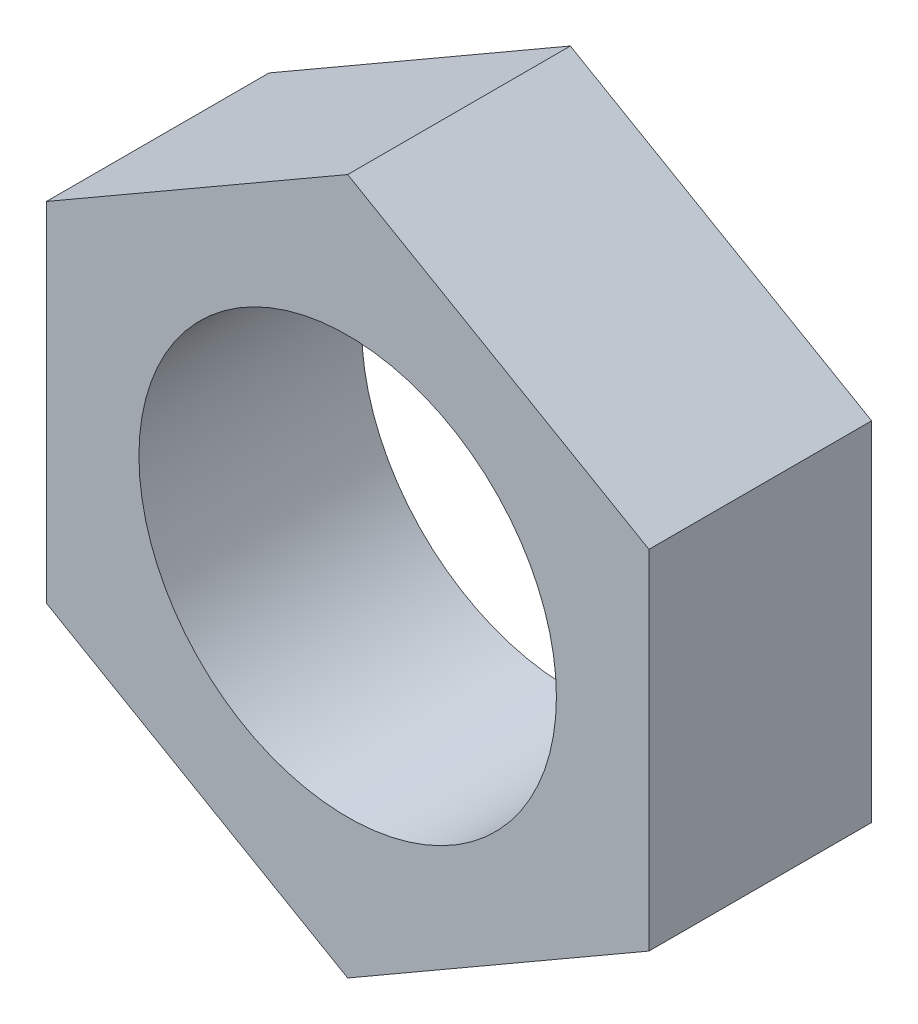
ISO-10303-21;
HEADER;
FILE_DESCRIPTION(('STEP AP214'),'2;1');
FILE_NAME('part.step','',(''),(''),'','','');
FILE_SCHEMA(('AUTOMOTIVE_DESIGN { 1 0 10303 214 1 1 1 1 }'));
ENDSEC;
DATA;
#1=APPLICATION_CONTEXT('core data for automotive mechanical design processes');
#2=APPLICATION_PROTOCOL_DEFINITION('international standard','automotive_design',2000,#1);
#3=PRODUCT_CONTEXT('',#1,'mechanical');
#4=PRODUCT('Part','Part','',(#3));
#5=PRODUCT_RELATED_PRODUCT_CATEGORY('part','',(#4));
#6=PRODUCT_DEFINITION_FORMATION('','',#4);
#7=PRODUCT_DEFINITION_CONTEXT('part definition',#1,'design');
#8=PRODUCT_DEFINITION('design','',#6,#7);
#9=PRODUCT_DEFINITION_SHAPE('','',#8);
#10=(LENGTH_UNIT() NAMED_UNIT(*) SI_UNIT(.MILLI.,.METRE.));
#11=(NAMED_UNIT(*) PLANE_ANGLE_UNIT() SI_UNIT($,.RADIAN.));
#12=(NAMED_UNIT(*) SI_UNIT($,.STERADIAN.) SOLID_ANGLE_UNIT());
#13=UNCERTAINTY_MEASURE_WITH_UNIT(LENGTH_MEASURE(1.E-05),#10,'distance_accuracy_value','');
#14=(GEOMETRIC_REPRESENTATION_CONTEXT(3) GLOBAL_UNCERTAINTY_ASSIGNED_CONTEXT((#13)) GLOBAL_UNIT_ASSIGNED_CONTEXT((#10,
#11,#12)) REPRESENTATION_CONTEXT('',''));
#15=CARTESIAN_POINT('',(0.,0.,0.));
#16=DIRECTION('',(0.,0.,1.));
#17=DIRECTION('',(1.,0.,0.));
#18=AXIS2_PLACEMENT_3D('',#15,#16,#17);
#19=CARTESIAN_POINT('',(0.,12.5,8.));
#20=DIRECTION('',(0.,0.,1.));
#21=DIRECTION('',(1.,0.,0.));
#22=AXIS2_PLACEMENT_3D('',#19,#20,#21);
#23=PLANE('',#22);
#24=DIRECTION('',(-0.866025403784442,0.499999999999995,0.));
#25=VECTOR('',#24,1.);
#26=CARTESIAN_POINT('',(10.8253175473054,6.25000000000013,8.));
#27=LINE('',#26,#25);
#28=CARTESIAN_POINT('',(10.8253175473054,6.25000000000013,8.));
#29=VERTEX_POINT('',#28);
#30=CARTESIAN_POINT('',(0.,12.5,8.));
#31=VERTEX_POINT('',#30);
#32=EDGE_CURVE('E126',#29,#31,#27,.T.);
#33=ORIENTED_EDGE('',*,*,#32,.T.);
#34=DIRECTION('',(-0.866025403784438,-0.500000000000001,0.));
#35=VECTOR('',#34,1.);
#36=CARTESIAN_POINT('',(0.,12.5,8.));
#37=LINE('',#36,#35);
#38=CARTESIAN_POINT('',(-10.8253175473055,6.24999999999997,8.));
#39=VERTEX_POINT('',#38);
#40=EDGE_CURVE('E84',#31,#39,#37,.T.);
#41=ORIENTED_EDGE('',*,*,#40,.T.);
#42=DIRECTION('',(0.,-1.,0.));
#43=VECTOR('',#42,1.);
#44=CARTESIAN_POINT('',(-10.8253175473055,6.24999999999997,8.));
#45=LINE('',#44,#43);
#46=CARTESIAN_POINT('',(-10.8253175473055,-6.25000000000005,8.));
#47=VERTEX_POINT('',#46);
#48=EDGE_CURVE('E97',#39,#47,#45,.T.);
#49=ORIENTED_EDGE('',*,*,#48,.T.);
#50=DIRECTION('',(0.866025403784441,-0.499999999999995,0.));
#51=VECTOR('',#50,1.);
#52=CARTESIAN_POINT('',(-10.8253175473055,-6.25000000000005,8.));
#53=LINE('',#52,#51);
#54=CARTESIAN_POINT('',(0.,-12.5,8.));
#55=VERTEX_POINT('',#54);
#56=EDGE_CURVE('E91',#47,#55,#53,.T.);
#57=ORIENTED_EDGE('',*,*,#56,.T.);
#58=DIRECTION('',(0.866025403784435,0.500000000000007,0.));
#59=VECTOR('',#58,1.);
#60=CARTESIAN_POINT('',(0.,-12.5,8.));
#61=LINE('',#60,#59);
#62=CARTESIAN_POINT('',(10.8253175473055,-6.2499999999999,8.));
#63=VERTEX_POINT('',#62);
#64=EDGE_CURVE('E95',#55,#63,#61,.T.);
#65=ORIENTED_EDGE('',*,*,#64,.T.);
#66=DIRECTION('',(0.,1.,0.));
#67=VECTOR('',#66,1.);
#68=CARTESIAN_POINT('',(10.8253175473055,-6.2499999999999,8.));
#69=LINE('',#68,#67);
#70=EDGE_CURVE('E47',#63,#29,#69,.T.);
#71=ORIENTED_EDGE('',*,*,#70,.T.);
#72=EDGE_LOOP('',(#33,#41,#49,#57,#65,#71));
#73=FACE_BOUND('',#72,.T.);
#74=CARTESIAN_POINT('',(0.,0.,8.));
#75=DIRECTION('',(0.,0.,1.));
#76=DIRECTION('',(1.,0.,0.));
#77=AXIS2_PLACEMENT_3D('',#74,#75,#76);
#78=CIRCLE('',#77,7.5);
#79=CARTESIAN_POINT('',(7.5,0.,8.));
#80=VERTEX_POINT('',#79);
#81=EDGE_CURVE('E119',#80,#80,#78,.T.);
#82=ORIENTED_EDGE('',*,*,#81,.F.);
#83=EDGE_LOOP('',(#82));
#84=FACE_BOUND('',#83,.T.);
#85=ADVANCED_FACE('F30',(#73,#84),#23,.T.);
#86=CARTESIAN_POINT('',(0.,12.5,0.));
#87=DIRECTION('',(0.,0.,1.));
#88=DIRECTION('',(1.,0.,0.));
#89=AXIS2_PLACEMENT_3D('',#86,#87,#88);
#90=PLANE('',#89);
#91=DIRECTION('',(-0.866025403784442,0.499999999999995,0.));
#92=VECTOR('',#91,1.);
#93=CARTESIAN_POINT('',(10.8253175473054,6.25000000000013,0.));
#94=LINE('',#93,#92);
#95=CARTESIAN_POINT('',(10.8253175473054,6.25000000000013,0.));
#96=VERTEX_POINT('',#95);
#97=CARTESIAN_POINT('',(0.,12.5,0.));
#98=VERTEX_POINT('',#97);
#99=EDGE_CURVE('E115',#96,#98,#94,.T.);
#100=ORIENTED_EDGE('',*,*,#99,.F.);
#101=DIRECTION('',(0.,1.,0.));
#102=VECTOR('',#101,1.);
#103=CARTESIAN_POINT('',(10.8253175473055,-6.2499999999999,0.));
#104=LINE('',#103,#102);
#105=CARTESIAN_POINT('',(10.8253175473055,-6.2499999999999,0.));
#106=VERTEX_POINT('',#105);
#107=EDGE_CURVE('E76',#106,#96,#104,.T.);
#108=ORIENTED_EDGE('',*,*,#107,.F.);
#109=DIRECTION('',(0.866025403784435,0.500000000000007,0.));
#110=VECTOR('',#109,1.);
#111=CARTESIAN_POINT('',(0.,-12.5,0.));
#112=LINE('',#111,#110);
#113=CARTESIAN_POINT('',(0.,-12.5,0.));
#114=VERTEX_POINT('',#113);
#115=EDGE_CURVE('E70',#114,#106,#112,.T.);
#116=ORIENTED_EDGE('',*,*,#115,.F.);
#117=DIRECTION('',(0.866025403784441,-0.499999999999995,0.));
#118=VECTOR('',#117,1.);
#119=CARTESIAN_POINT('',(-10.8253175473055,-6.25000000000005,0.));
#120=LINE('',#119,#118);
#121=CARTESIAN_POINT('',(-10.8253175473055,-6.25000000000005,0.));
#122=VERTEX_POINT('',#121);
#123=EDGE_CURVE('E105',#122,#114,#120,.T.);
#124=ORIENTED_EDGE('',*,*,#123,.F.);
#125=DIRECTION('',(0.,-1.,0.));
#126=VECTOR('',#125,1.);
#127=CARTESIAN_POINT('',(-10.8253175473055,6.24999999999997,0.));
#128=LINE('',#127,#126);
#129=CARTESIAN_POINT('',(-10.8253175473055,6.24999999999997,0.));
#130=VERTEX_POINT('',#129);
#131=EDGE_CURVE('E121',#130,#122,#128,.T.);
#132=ORIENTED_EDGE('',*,*,#131,.F.);
#133=DIRECTION('',(-0.866025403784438,-0.500000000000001,0.));
#134=VECTOR('',#133,1.);
#135=CARTESIAN_POINT('',(0.,12.5,0.));
#136=LINE('',#135,#134);
#137=EDGE_CURVE('E118',#98,#130,#136,.T.);
#138=ORIENTED_EDGE('',*,*,#137,.F.);
#139=EDGE_LOOP('',(#100,#108,#116,#124,#132,#138));
#140=FACE_BOUND('',#139,.T.);
#141=CARTESIAN_POINT('',(0.,0.,0.));
#142=DIRECTION('',(0.,0.,1.));
#143=DIRECTION('',(1.,0.,0.));
#144=AXIS2_PLACEMENT_3D('',#141,#142,#143);
#145=CIRCLE('',#144,7.5);
#146=CARTESIAN_POINT('',(7.5,0.,0.));
#147=VERTEX_POINT('',#146);
#148=EDGE_CURVE('E219',#147,#147,#145,.T.);
#149=ORIENTED_EDGE('',*,*,#148,.T.);
#150=EDGE_LOOP('',(#149));
#151=FACE_BOUND('',#150,.T.);
#152=ADVANCED_FACE('F135',(#140,#151),#90,.F.);
#153=CARTESIAN_POINT('',(10.8253175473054,6.25000000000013,8.));
#154=DIRECTION('',(-0.499999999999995,-0.866025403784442,0.));
#155=DIRECTION('',(0.866025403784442,-0.499999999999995,0.));
#156=AXIS2_PLACEMENT_3D('',#153,#154,#155);
#157=PLANE('',#156);
#158=ORIENTED_EDGE('',*,*,#99,.T.);
#159=DIRECTION('',(0.,0.,-1.));
#160=VECTOR('',#159,1.);
#161=CARTESIAN_POINT('',(0.,12.5,8.));
#162=LINE('',#161,#160);
#163=EDGE_CURVE('E11',#31,#98,#162,.T.);
#164=ORIENTED_EDGE('',*,*,#163,.F.);
#165=ORIENTED_EDGE('',*,*,#32,.F.);
#166=DIRECTION('',(0.,0.,-1.));
#167=VECTOR('',#166,1.);
#168=CARTESIAN_POINT('',(10.8253175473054,6.25000000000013,8.));
#169=LINE('',#168,#167);
#170=EDGE_CURVE('E111',#29,#96,#169,.T.);
#171=ORIENTED_EDGE('',*,*,#170,.T.);
#172=EDGE_LOOP('',(#158,#164,#165,#171));
#173=FACE_BOUND('',#172,.T.);
#174=ADVANCED_FACE('F32',(#173),#157,.F.);
#175=CARTESIAN_POINT('',(0.,12.5,8.));
#176=DIRECTION('',(0.500000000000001,-0.866025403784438,0.));
#177=DIRECTION('',(0.866025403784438,0.500000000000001,0.));
#178=AXIS2_PLACEMENT_3D('',#175,#176,#177);
#179=PLANE('',#178);
#180=ORIENTED_EDGE('',*,*,#137,.T.);
#181=DIRECTION('',(0.,0.,-1.));
#182=VECTOR('',#181,1.);
#183=CARTESIAN_POINT('',(-10.8253175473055,6.24999999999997,8.));
#184=LINE('',#183,#182);
#185=EDGE_CURVE('E39',#39,#130,#184,.T.);
#186=ORIENTED_EDGE('',*,*,#185,.F.);
#187=ORIENTED_EDGE('',*,*,#40,.F.);
#188=ORIENTED_EDGE('',*,*,#163,.T.);
#189=EDGE_LOOP('',(#180,#186,#187,#188));
#190=FACE_BOUND('',#189,.T.);
#191=ADVANCED_FACE('F160',(#190),#179,.F.);
#192=CARTESIAN_POINT('',(-10.8253175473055,6.24999999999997,8.));
#193=DIRECTION('',(1.,0.,0.));
#194=DIRECTION('',(0.,1.,0.));
#195=AXIS2_PLACEMENT_3D('',#192,#193,#194);
#196=PLANE('',#195);
#197=ORIENTED_EDGE('',*,*,#131,.T.);
#198=DIRECTION('',(0.,0.,-1.));
#199=VECTOR('',#198,1.);
#200=CARTESIAN_POINT('',(-10.8253175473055,-6.25000000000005,8.));
#201=LINE('',#200,#199);
#202=EDGE_CURVE('E106',#47,#122,#201,.T.);
#203=ORIENTED_EDGE('',*,*,#202,.F.);
#204=ORIENTED_EDGE('',*,*,#48,.F.);
#205=ORIENTED_EDGE('',*,*,#185,.T.);
#206=EDGE_LOOP('',(#197,#203,#204,#205));
#207=FACE_BOUND('',#206,.T.);
#208=ADVANCED_FACE('F132',(#207),#196,.F.);
#209=CARTESIAN_POINT('',(-10.8253175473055,-6.25000000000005,8.));
#210=DIRECTION('',(0.499999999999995,0.866025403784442,0.));
#211=DIRECTION('',(-0.866025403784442,0.499999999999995,0.));
#212=AXIS2_PLACEMENT_3D('',#209,#210,#211);
#213=PLANE('',#212);
#214=ORIENTED_EDGE('',*,*,#123,.T.);
#215=DIRECTION('',(0.,0.,-1.));
#216=VECTOR('',#215,1.);
#217=CARTESIAN_POINT('',(0.,-12.5,8.));
#218=LINE('',#217,#216);
#219=EDGE_CURVE('E102',#55,#114,#218,.T.);
#220=ORIENTED_EDGE('',*,*,#219,.F.);
#221=ORIENTED_EDGE('',*,*,#56,.F.);
#222=ORIENTED_EDGE('',*,*,#202,.T.);
#223=EDGE_LOOP('',(#214,#220,#221,#222));
#224=FACE_BOUND('',#223,.T.);
#225=ADVANCED_FACE('F103',(#224),#213,.F.);
#226=CARTESIAN_POINT('',(0.,-12.5,8.));
#227=DIRECTION('',(-0.500000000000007,0.866025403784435,0.));
#228=DIRECTION('',(-0.866025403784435,-0.500000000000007,0.));
#229=AXIS2_PLACEMENT_3D('',#226,#227,#228);
#230=PLANE('',#229);
#231=ORIENTED_EDGE('',*,*,#115,.T.);
#232=DIRECTION('',(0.,0.,-1.));
#233=VECTOR('',#232,1.);
#234=CARTESIAN_POINT('',(10.8253175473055,-6.2499999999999,8.));
#235=LINE('',#234,#233);
#236=EDGE_CURVE('E107',#63,#106,#235,.T.);
#237=ORIENTED_EDGE('',*,*,#236,.F.);
#238=ORIENTED_EDGE('',*,*,#64,.F.);
#239=ORIENTED_EDGE('',*,*,#219,.T.);
#240=EDGE_LOOP('',(#231,#237,#238,#239));
#241=FACE_BOUND('',#240,.T.);
#242=ADVANCED_FACE('F109',(#241),#230,.F.);
#243=CARTESIAN_POINT('',(10.8253175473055,-6.2499999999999,8.));
#244=DIRECTION('',(-1.,0.,0.));
#245=DIRECTION('',(0.,-1.,0.));
#246=AXIS2_PLACEMENT_3D('',#243,#244,#245);
#247=PLANE('',#246);
#248=ORIENTED_EDGE('',*,*,#107,.T.);
#249=ORIENTED_EDGE('',*,*,#170,.F.);
#250=ORIENTED_EDGE('',*,*,#70,.F.);
#251=ORIENTED_EDGE('',*,*,#236,.T.);
#252=EDGE_LOOP('',(#248,#249,#250,#251));
#253=FACE_BOUND('',#252,.T.);
#254=ADVANCED_FACE('F140',(#253),#247,.F.);
#255=CARTESIAN_POINT('',(0.,0.,8.));
#256=DIRECTION('',(0.,0.,-1.));
#257=DIRECTION('',(-1.,0.,0.));
#258=AXIS2_PLACEMENT_3D('',#255,#256,#257);
#259=CYLINDRICAL_SURFACE('',#258,7.5);
#260=ORIENTED_EDGE('',*,*,#81,.T.);
#261=EDGE_LOOP('',(#260));
#262=FACE_BOUND('',#261,.T.);
#263=ORIENTED_EDGE('',*,*,#148,.F.);
#264=EDGE_LOOP('',(#263));
#265=FACE_BOUND('',#264,.T.);
#266=ADVANCED_FACE('F142',(#262,#265),#259,.F.);
#267=CLOSED_SHELL('',(#85,#152,#174,#191,#208,#225,#242,#254,#266));
#268=MANIFOLD_SOLID_BREP('B2',#267);
#269=ADVANCED_BREP_SHAPE_REPRESENTATION('',(#18,#268),#14);
#270=SHAPE_DEFINITION_REPRESENTATION(#9,#269);
ENDSEC;
END-ISO-10303-21;
